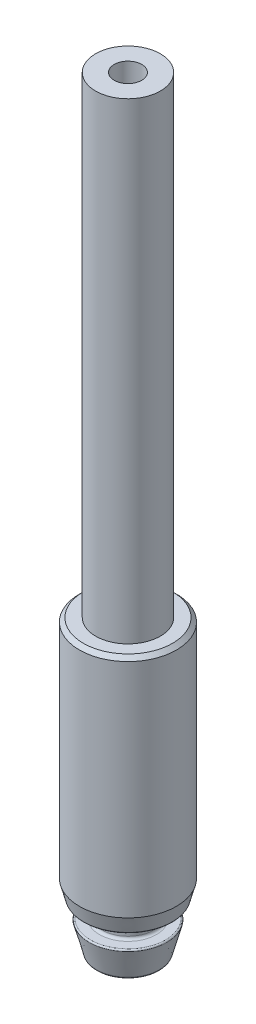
ISO-10303-21;
HEADER;
FILE_DESCRIPTION(('STEP AP214'),'2;1');
FILE_NAME('part.step','',(''),(''),'','','');
FILE_SCHEMA(('AUTOMOTIVE_DESIGN { 1 0 10303 214 1 1 1 1 }'));
ENDSEC;
DATA;
#1=APPLICATION_CONTEXT('core data for automotive mechanical design processes');
#2=APPLICATION_PROTOCOL_DEFINITION('international standard','automotive_design',2000,#1);
#3=PRODUCT_CONTEXT('',#1,'mechanical');
#4=PRODUCT('Part','Part','',(#3));
#5=PRODUCT_RELATED_PRODUCT_CATEGORY('part','',(#4));
#6=PRODUCT_DEFINITION_FORMATION('','',#4);
#7=PRODUCT_DEFINITION_CONTEXT('part definition',#1,'design');
#8=PRODUCT_DEFINITION('design','',#6,#7);
#9=PRODUCT_DEFINITION_SHAPE('','',#8);
#10=(LENGTH_UNIT() NAMED_UNIT(*) SI_UNIT(.MILLI.,.METRE.));
#11=(NAMED_UNIT(*) PLANE_ANGLE_UNIT() SI_UNIT($,.RADIAN.));
#12=(NAMED_UNIT(*) SI_UNIT($,.STERADIAN.) SOLID_ANGLE_UNIT());
#13=UNCERTAINTY_MEASURE_WITH_UNIT(LENGTH_MEASURE(1.E-05),#10,'distance_accuracy_value','');
#14=(GEOMETRIC_REPRESENTATION_CONTEXT(3) GLOBAL_UNCERTAINTY_ASSIGNED_CONTEXT((#13)) GLOBAL_UNIT_ASSIGNED_CONTEXT((#10,
#11,#12)) REPRESENTATION_CONTEXT('',''));
#15=CARTESIAN_POINT('',(0.,0.,0.));
#16=DIRECTION('',(0.,0.,1.));
#17=DIRECTION('',(1.,0.,0.));
#18=AXIS2_PLACEMENT_3D('',#15,#16,#17);
#19=CARTESIAN_POINT('',(0.,0.,0.));
#20=DIRECTION('',(0.,1.,0.));
#21=DIRECTION('',(0.,0.,1.));
#22=AXIS2_PLACEMENT_3D('',#19,#20,#21);
#23=CONICAL_SURFACE('',#22,3.048,0.26179938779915);
#24=CARTESIAN_POINT('',(0.,4.88610043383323,0.));
#25=DIRECTION('',(0.,1.,0.));
#26=DIRECTION('',(0.,0.,1.));
#27=AXIS2_PLACEMENT_3D('',#24,#25,#26);
#28=CIRCLE('',#27,4.35722666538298);
#29=CARTESIAN_POINT('',(0.,4.88610043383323,4.35722666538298));
#30=VERTEX_POINT('',#29);
#31=EDGE_CURVE('E92',#30,#30,#28,.T.);
#32=ORIENTED_EDGE('',*,*,#31,.T.);
#33=EDGE_LOOP('',(#32));
#34=FACE_BOUND('',#33,.T.);
#35=CARTESIAN_POINT('',(0.,6.39860110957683,0.));
#36=DIRECTION('',(0.,-1.,0.));
#37=DIRECTION('',(0.,0.,-1.));
#38=AXIS2_PLACEMENT_3D('',#35,#36,#37);
#39=CIRCLE('',#38,4.7625);
#40=CARTESIAN_POINT('',(0.,6.39860110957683,-4.7625));
#41=VERTEX_POINT('',#40);
#42=EDGE_CURVE('E80',#41,#41,#39,.T.);
#43=ORIENTED_EDGE('',*,*,#42,.T.);
#44=EDGE_LOOP('',(#43));
#45=FACE_BOUND('',#44,.T.);
#46=ADVANCED_FACE('F49',(#34,#45),#23,.T.);
#47=CARTESIAN_POINT('',(0.,28.575,0.));
#48=DIRECTION('',(0.,1.,0.));
#49=DIRECTION('',(0.,0.,1.));
#50=AXIS2_PLACEMENT_3D('',#47,#48,#49);
#51=PLANE('',#50);
#52=CARTESIAN_POINT('',(0.,28.575,0.));
#53=DIRECTION('',(0.,1.,0.));
#54=DIRECTION('',(0.,0.,1.));
#55=AXIS2_PLACEMENT_3D('',#52,#53,#54);
#56=CIRCLE('',#55,4.3815);
#57=CARTESIAN_POINT('',(0.,28.575,4.3815));
#58=VERTEX_POINT('',#57);
#59=EDGE_CURVE('E86',#58,#58,#56,.T.);
#60=ORIENTED_EDGE('',*,*,#59,.T.);
#61=EDGE_LOOP('',(#60));
#62=FACE_BOUND('',#61,.T.);
#63=CARTESIAN_POINT('',(0.,28.575,0.));
#64=DIRECTION('',(0.,-1.,0.));
#65=DIRECTION('',(0.,0.,-1.));
#66=AXIS2_PLACEMENT_3D('',#63,#64,#65);
#67=CIRCLE('',#66,3.175);
#68=CARTESIAN_POINT('',(0.,28.575,-3.175));
#69=VERTEX_POINT('',#68);
#70=EDGE_CURVE('E73',#69,#69,#67,.T.);
#71=ORIENTED_EDGE('',*,*,#70,.T.);
#72=EDGE_LOOP('',(#71));
#73=FACE_BOUND('',#72,.T.);
#74=ADVANCED_FACE('F128',(#62,#73),#51,.T.);
#75=CARTESIAN_POINT('',(0.,-5.97869553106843E-13,0.));
#76=DIRECTION('',(0.,-1.,0.));
#77=DIRECTION('',(0.,0.,-1.));
#78=AXIS2_PLACEMENT_3D('',#75,#76,#77);
#79=CYLINDRICAL_SURFACE('',#78,4.7625);
#80=CARTESIAN_POINT('',(0.,28.194,0.));
#81=DIRECTION('',(0.,1.,0.));
#82=DIRECTION('',(0.,0.,1.));
#83=AXIS2_PLACEMENT_3D('',#80,#81,#82);
#84=CIRCLE('',#83,4.7625);
#85=CARTESIAN_POINT('',(0.,28.194,4.7625));
#86=VERTEX_POINT('',#85);
#87=EDGE_CURVE('E83',#86,#86,#84,.F.);
#88=ORIENTED_EDGE('',*,*,#87,.T.);
#89=EDGE_LOOP('',(#88));
#90=FACE_BOUND('',#89,.T.);
#91=ORIENTED_EDGE('',*,*,#42,.F.);
#92=EDGE_LOOP('',(#91));
#93=FACE_BOUND('',#92,.T.);
#94=ADVANCED_FACE('F137',(#90,#93),#79,.T.);
#95=CARTESIAN_POINT('',(0.,-5.97869553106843E-13,0.));
#96=DIRECTION('',(0.,-1.,0.));
#97=DIRECTION('',(0.,0.,-1.));
#98=AXIS2_PLACEMENT_3D('',#95,#96,#97);
#99=CYLINDRICAL_SURFACE('',#98,3.175);
#100=CARTESIAN_POINT('',(0.,74.93,0.));
#101=DIRECTION('',(0.,-1.,0.));
#102=DIRECTION('',(0.,0.,-1.));
#103=AXIS2_PLACEMENT_3D('',#100,#101,#102);
#104=CIRCLE('',#103,3.175);
#105=CARTESIAN_POINT('',(0.,74.93,-3.175));
#106=VERTEX_POINT('',#105);
#107=EDGE_CURVE('E69',#106,#106,#104,.T.);
#108=ORIENTED_EDGE('',*,*,#107,.T.);
#109=EDGE_LOOP('',(#108));
#110=FACE_BOUND('',#109,.T.);
#111=ORIENTED_EDGE('',*,*,#70,.F.);
#112=EDGE_LOOP('',(#111));
#113=FACE_BOUND('',#112,.T.);
#114=ADVANCED_FACE('F184',(#110,#113),#99,.T.);
#115=CARTESIAN_POINT('',(0.,74.93,0.));
#116=DIRECTION('',(0.,1.,0.));
#117=DIRECTION('',(0.,0.,1.));
#118=AXIS2_PLACEMENT_3D('',#115,#116,#117);
#119=PLANE('',#118);
#120=CARTESIAN_POINT('',(0.,74.93,0.));
#121=DIRECTION('',(0.,1.,0.));
#122=DIRECTION('',(0.,0.,1.));
#123=AXIS2_PLACEMENT_3D('',#120,#121,#122);
#124=CIRCLE('',#123,1.35254999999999);
#125=CARTESIAN_POINT('',(0.,74.93,1.35254999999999));
#126=VERTEX_POINT('',#125);
#127=EDGE_CURVE('E70',#126,#126,#124,.T.);
#128=ORIENTED_EDGE('',*,*,#127,.F.);
#129=EDGE_LOOP('',(#128));
#130=FACE_BOUND('',#129,.T.);
#131=ORIENTED_EDGE('',*,*,#107,.F.);
#132=EDGE_LOOP('',(#131));
#133=FACE_BOUND('',#132,.T.);
#134=ADVANCED_FACE('F63',(#130,#133),#119,.T.);
#135=CARTESIAN_POINT('',(0.,65.532,0.));
#136=DIRECTION('',(0.,1.,0.));
#137=DIRECTION('',(0.,0.,1.));
#138=AXIS2_PLACEMENT_3D('',#135,#136,#137);
#139=CONICAL_SURFACE('',#138,1.35255,1.02974425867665);
#140=CARTESIAN_POINT('',(0.,64.7193059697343,0.));
#141=VERTEX_POINT('',#140);
#142=VERTEX_LOOP('',#141);
#143=FACE_BOUND('',#142,.T.);
#144=CARTESIAN_POINT('',(0.,65.532,0.));
#145=DIRECTION('',(0.,1.,0.));
#146=DIRECTION('',(0.,0.,1.));
#147=AXIS2_PLACEMENT_3D('',#144,#145,#146);
#148=CIRCLE('',#147,1.35255);
#149=CARTESIAN_POINT('',(0.,65.532,1.35255));
#150=VERTEX_POINT('',#149);
#151=EDGE_CURVE('E67',#150,#150,#148,.T.);
#152=ORIENTED_EDGE('',*,*,#151,.T.);
#153=EDGE_LOOP('',(#152));
#154=FACE_BOUND('',#153,.T.);
#155=ADVANCED_FACE('F59',(#143,#154),#139,.F.);
#156=CARTESIAN_POINT('',(0.,74.93,0.));
#157=DIRECTION('',(0.,1.,0.));
#158=DIRECTION('',(0.,0.,1.));
#159=AXIS2_PLACEMENT_3D('',#156,#157,#158);
#160=CYLINDRICAL_SURFACE('',#159,1.35254999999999);
#161=ORIENTED_EDGE('',*,*,#151,.F.);
#162=EDGE_LOOP('',(#161));
#163=FACE_BOUND('',#162,.T.);
#164=ORIENTED_EDGE('',*,*,#127,.T.);
#165=EDGE_LOOP('',(#164));
#166=FACE_BOUND('',#165,.T.);
#167=ADVANCED_FACE('F62',(#163,#166),#160,.F.);
#168=CARTESIAN_POINT('',(0.,28.194,0.));
#169=DIRECTION('',(0.,-1.,0.));
#170=DIRECTION('',(0.,0.,-1.));
#171=AXIS2_PLACEMENT_3D('',#168,#169,#170);
#172=CONICAL_SURFACE('',#171,4.7625,0.785398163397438);
#173=ORIENTED_EDGE('',*,*,#59,.F.);
#174=EDGE_LOOP('',(#173));
#175=FACE_BOUND('',#174,.T.);
#176=ORIENTED_EDGE('',*,*,#87,.F.);
#177=EDGE_LOOP('',(#176));
#178=FACE_BOUND('',#177,.T.);
#179=ADVANCED_FACE('F166',(#175,#178),#172,.T.);
#180=CARTESIAN_POINT('',(0.,-5.97869553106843E-13,0.));
#181=DIRECTION('',(0.,-1.,0.));
#182=DIRECTION('',(0.,0.,-1.));
#183=AXIS2_PLACEMENT_3D('',#180,#181,#182);
#184=CYLINDRICAL_SURFACE('',#183,2.54187404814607);
#185=CARTESIAN_POINT('',(0.,3.26797045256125,0.));
#186=DIRECTION('',(0.,-1.,0.));
#187=DIRECTION('',(0.,0.,-1.));
#188=AXIS2_PLACEMENT_3D('',#185,#186,#187);
#189=CIRCLE('',#188,2.54187404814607);
#190=CARTESIAN_POINT('',(0.,3.26797045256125,-2.54187404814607));
#191=VERTEX_POINT('',#190);
#192=EDGE_CURVE('E107',#191,#191,#189,.F.);
#193=ORIENTED_EDGE('',*,*,#192,.T.);
#194=EDGE_LOOP('',(#193));
#195=FACE_BOUND('',#194,.T.);
#196=CARTESIAN_POINT('',(0.,4.53797045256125,0.));
#197=DIRECTION('',(0.,1.,0.));
#198=DIRECTION('',(0.,0.,1.));
#199=AXIS2_PLACEMENT_3D('',#196,#197,#198);
#200=CIRCLE('',#199,2.54187404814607);
#201=CARTESIAN_POINT('',(0.,4.53797045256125,2.54187404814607));
#202=VERTEX_POINT('',#201);
#203=EDGE_CURVE('E104',#202,#202,#200,.F.);
#204=ORIENTED_EDGE('',*,*,#203,.T.);
#205=EDGE_LOOP('',(#204));
#206=FACE_BOUND('',#205,.T.);
#207=ADVANCED_FACE('F169',(#195,#206),#184,.T.);
#208=CARTESIAN_POINT('',(2.54187404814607,3.01397045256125,0.));
#209=DIRECTION('',(0.,-1.,0.));
#210=DIRECTION('',(0.,0.,-1.));
#211=AXIS2_PLACEMENT_3D('',#208,#209,#210);
#212=PLANE('',#211);
#213=CARTESIAN_POINT('',(0.,3.01397045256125,0.));
#214=DIRECTION('',(0.,-1.,0.));
#215=DIRECTION('',(0.,0.,-1.));
#216=AXIS2_PLACEMENT_3D('',#213,#214,#215);
#217=CIRCLE('',#216,2.79587404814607);
#218=CARTESIAN_POINT('',(0.,3.01397045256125,-2.79587404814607));
#219=VERTEX_POINT('',#218);
#220=EDGE_CURVE('E101',#219,#219,#217,.T.);
#221=ORIENTED_EDGE('',*,*,#220,.T.);
#222=EDGE_LOOP('',(#221));
#223=FACE_BOUND('',#222,.T.);
#224=CARTESIAN_POINT('',(0.,3.01397045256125,0.));
#225=DIRECTION('',(0.,-1.,0.));
#226=DIRECTION('',(0.,0.,-1.));
#227=AXIS2_PLACEMENT_3D('',#224,#225,#226);
#228=CIRCLE('',#227,3.69008132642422);
#229=CARTESIAN_POINT('',(0.,3.01397045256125,-3.69008132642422));
#230=VERTEX_POINT('',#229);
#231=EDGE_CURVE('E98',#230,#230,#228,.F.);
#232=ORIENTED_EDGE('',*,*,#231,.T.);
#233=EDGE_LOOP('',(#232));
#234=FACE_BOUND('',#233,.T.);
#235=ADVANCED_FACE('F174',(#223,#234),#212,.F.);
#236=CARTESIAN_POINT('',(4.33200461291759,4.79197045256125,0.));
#237=DIRECTION('',(0.,1.,0.));
#238=DIRECTION('',(0.,0.,1.));
#239=AXIS2_PLACEMENT_3D('',#236,#237,#238);
#240=PLANE('',#239);
#241=CARTESIAN_POINT('',(0.,4.79197045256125,0.));
#242=DIRECTION('',(0.,1.,0.));
#243=DIRECTION('',(0.,0.,1.));
#244=AXIS2_PLACEMENT_3D('',#241,#242,#243);
#245=CIRCLE('',#244,2.79587404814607);
#246=CARTESIAN_POINT('',(0.,4.79197045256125,2.79587404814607));
#247=VERTEX_POINT('',#246);
#248=EDGE_CURVE('E110',#247,#247,#245,.T.);
#249=ORIENTED_EDGE('',*,*,#248,.T.);
#250=EDGE_LOOP('',(#249));
#251=FACE_BOUND('',#250,.T.);
#252=CARTESIAN_POINT('',(0.,4.79197045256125,0.));
#253=DIRECTION('',(0.,1.,0.));
#254=DIRECTION('',(0.,0.,1.));
#255=AXIS2_PLACEMENT_3D('',#252,#253,#254);
#256=CIRCLE('',#255,4.23455408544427);
#257=CARTESIAN_POINT('',(0.,4.79197045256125,4.23455408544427));
#258=VERTEX_POINT('',#257);
#259=EDGE_CURVE('E89',#258,#258,#256,.F.);
#260=ORIENTED_EDGE('',*,*,#259,.T.);
#261=EDGE_LOOP('',(#260));
#262=FACE_BOUND('',#261,.T.);
#263=ADVANCED_FACE('F151',(#251,#262),#240,.F.);
#264=CARTESIAN_POINT('',(0.,0.,0.));
#265=DIRECTION('',(0.,-1.,0.));
#266=DIRECTION('',(0.,0.,-1.));
#267=AXIS2_PLACEMENT_3D('',#264,#265,#266);
#268=PLANE('',#267);
#269=CARTESIAN_POINT('',(0.,0.,0.));
#270=DIRECTION('',(0.,-1.,0.));
#271=DIRECTION('',(0.,0.,-1.));
#272=AXIS2_PLACEMENT_3D('',#269,#270,#271);
#273=CIRCLE('',#272,2.85309894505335);
#274=CARTESIAN_POINT('',(0.,0.,-2.85309894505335));
#275=VERTEX_POINT('',#274);
#276=EDGE_CURVE('E56',#275,#275,#273,.T.);
#277=ORIENTED_EDGE('',*,*,#276,.T.);
#278=EDGE_LOOP('',(#277));
#279=FACE_BOUND('',#278,.T.);
#280=ADVANCED_FACE('F115',(#279),#268,.T.);
#281=CARTESIAN_POINT('',(0.,0.188259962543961,0.));
#282=DIRECTION('',(0.,-1.,0.));
#283=DIRECTION('',(0.,0.,-1.));
#284=AXIS2_PLACEMENT_3D('',#281,#282,#283);
#285=CIRCLE('',#284,3.09844410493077);
#286=CARTESIAN_POINT('',(0.,0.188259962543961,-3.09844410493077));
#287=VERTEX_POINT('',#286);
#288=EDGE_CURVE('E11',#287,#287,#285,.F.);
#289=ORIENTED_EDGE('',*,*,#288,.T.);
#290=EDGE_LOOP('',(#289));
#291=FACE_BOUND('',#290,.T.);
#292=CARTESIAN_POINT('',(0.,2.85410043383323,0.));
#293=DIRECTION('',(0.,1.,0.));
#294=DIRECTION('',(0.,0.,1.));
#295=AXIS2_PLACEMENT_3D('',#292,#293,#294);
#296=CIRCLE('',#295,3.81275390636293);
#297=CARTESIAN_POINT('',(0.,2.85410043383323,3.81275390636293));
#298=VERTEX_POINT('',#297);
#299=EDGE_CURVE('E95',#298,#298,#296,.F.);
#300=ORIENTED_EDGE('',*,*,#299,.T.);
#301=EDGE_LOOP('',(#300));
#302=FACE_BOUND('',#301,.T.);
#303=ADVANCED_FACE('F131',(#291,#302),#23,.T.);
#304=CARTESIAN_POINT('',(0.,4.91897045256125,0.));
#305=DIRECTION('',(0.,1.,0.));
#306=DIRECTION('',(0.,0.,1.));
#307=AXIS2_PLACEMENT_3D('',#304,#305,#306);
#308=TOROIDAL_SURFACE('',#307,4.23455408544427,0.127);
#309=ORIENTED_EDGE('',*,*,#31,.F.);
#310=EDGE_LOOP('',(#309));
#311=FACE_BOUND('',#310,.T.);
#312=ORIENTED_EDGE('',*,*,#259,.F.);
#313=EDGE_LOOP('',(#312));
#314=FACE_BOUND('',#313,.T.);
#315=ADVANCED_FACE('F143',(#311,#314),#308,.T.);
#316=CARTESIAN_POINT('',(0.,2.88697045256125,0.));
#317=DIRECTION('',(0.,-1.,0.));
#318=DIRECTION('',(0.,0.,-1.));
#319=AXIS2_PLACEMENT_3D('',#316,#317,#318);
#320=TOROIDAL_SURFACE('',#319,3.69008132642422,0.127);
#321=ORIENTED_EDGE('',*,*,#231,.F.);
#322=EDGE_LOOP('',(#321));
#323=FACE_BOUND('',#322,.T.);
#324=ORIENTED_EDGE('',*,*,#299,.F.);
#325=EDGE_LOOP('',(#324));
#326=FACE_BOUND('',#325,.T.);
#327=ADVANCED_FACE('F148',(#323,#326),#320,.T.);
#328=CARTESIAN_POINT('',(0.,3.26797045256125,0.));
#329=DIRECTION('',(0.,-1.,0.));
#330=DIRECTION('',(0.,0.,-1.));
#331=AXIS2_PLACEMENT_3D('',#328,#329,#330);
#332=TOROIDAL_SURFACE('',#331,2.79587404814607,0.254);
#333=ORIENTED_EDGE('',*,*,#192,.F.);
#334=EDGE_LOOP('',(#333));
#335=FACE_BOUND('',#334,.T.);
#336=ORIENTED_EDGE('',*,*,#220,.F.);
#337=EDGE_LOOP('',(#336));
#338=FACE_BOUND('',#337,.T.);
#339=ADVANCED_FACE('F124',(#335,#338),#332,.F.);
#340=CARTESIAN_POINT('',(0.,4.53797045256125,0.));
#341=DIRECTION('',(0.,1.,0.));
#342=DIRECTION('',(0.,0.,1.));
#343=AXIS2_PLACEMENT_3D('',#340,#341,#342);
#344=TOROIDAL_SURFACE('',#343,2.79587404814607,0.254);
#345=ORIENTED_EDGE('',*,*,#248,.F.);
#346=EDGE_LOOP('',(#345));
#347=FACE_BOUND('',#346,.T.);
#348=ORIENTED_EDGE('',*,*,#203,.F.);
#349=EDGE_LOOP('',(#348));
#350=FACE_BOUND('',#349,.T.);
#351=ADVANCED_FACE('F118',(#347,#350),#344,.F.);
#352=CARTESIAN_POINT('',(0.,0.254,0.));
#353=DIRECTION('',(0.,-1.,0.));
#354=DIRECTION('',(0.,0.,-1.));
#355=AXIS2_PLACEMENT_3D('',#352,#353,#354);
#356=TOROIDAL_SURFACE('',#355,2.85309894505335,0.254);
#357=ORIENTED_EDGE('',*,*,#288,.F.);
#358=EDGE_LOOP('',(#357));
#359=FACE_BOUND('',#358,.T.);
#360=ORIENTED_EDGE('',*,*,#276,.F.);
#361=EDGE_LOOP('',(#360));
#362=FACE_BOUND('',#361,.T.);
#363=ADVANCED_FACE('F51',(#359,#362),#356,.T.);
#364=CLOSED_SHELL('',(#46,#74,#94,#114,#134,#155,#167,#179,#207,#235,#263,#280,#303,#315,#327,
#339,#351,#363));
#365=MANIFOLD_SOLID_BREP('B2',#364);
#366=ADVANCED_BREP_SHAPE_REPRESENTATION('',(#18,#365),#14);
#367=SHAPE_DEFINITION_REPRESENTATION(#9,#366);
ENDSEC;
END-ISO-10303-21;
